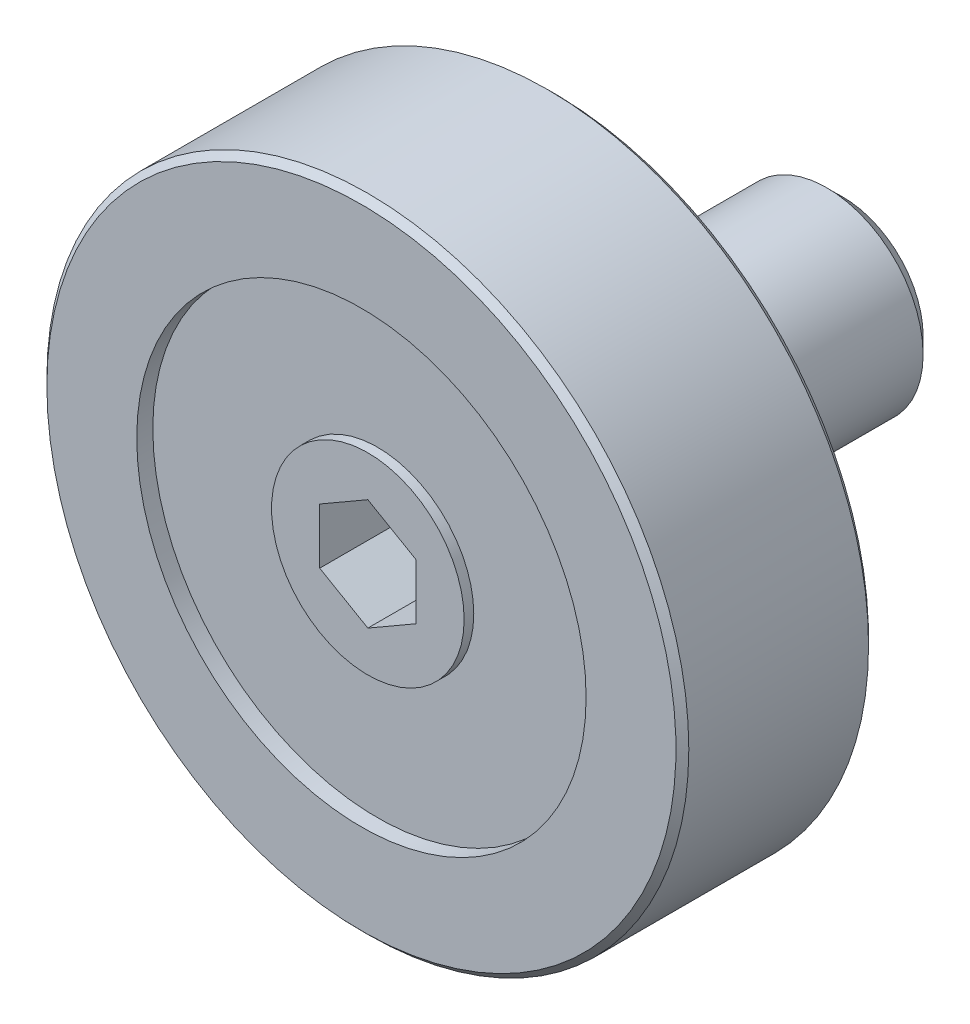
ISO-10303-21;
HEADER;
FILE_DESCRIPTION(('STEP AP214'),'2;1');
FILE_NAME('part.step','',(''),(''),'','','');
FILE_SCHEMA(('AUTOMOTIVE_DESIGN { 1 0 10303 214 1 1 1 1 }'));
ENDSEC;
DATA;
#1=APPLICATION_CONTEXT('core data for automotive mechanical design processes');
#2=APPLICATION_PROTOCOL_DEFINITION('international standard','automotive_design',2000,#1);
#3=PRODUCT_CONTEXT('',#1,'mechanical');
#4=PRODUCT('Part','Part','',(#3));
#5=PRODUCT_RELATED_PRODUCT_CATEGORY('part','',(#4));
#6=PRODUCT_DEFINITION_FORMATION('','',#4);
#7=PRODUCT_DEFINITION_CONTEXT('part definition',#1,'design');
#8=PRODUCT_DEFINITION('design','',#6,#7);
#9=PRODUCT_DEFINITION_SHAPE('','',#8);
#10=(LENGTH_UNIT() NAMED_UNIT(*) SI_UNIT(.MILLI.,.METRE.));
#11=(NAMED_UNIT(*) PLANE_ANGLE_UNIT() SI_UNIT($,.RADIAN.));
#12=(NAMED_UNIT(*) SI_UNIT($,.STERADIAN.) SOLID_ANGLE_UNIT());
#13=UNCERTAINTY_MEASURE_WITH_UNIT(LENGTH_MEASURE(1.E-05),#10,'distance_accuracy_value','');
#14=(GEOMETRIC_REPRESENTATION_CONTEXT(3) GLOBAL_UNCERTAINTY_ASSIGNED_CONTEXT((#13)) GLOBAL_UNIT_ASSIGNED_CONTEXT((#10,
#11,#12)) REPRESENTATION_CONTEXT('',''));
#15=CARTESIAN_POINT('',(0.,0.,0.));
#16=DIRECTION('',(0.,0.,1.));
#17=DIRECTION('',(1.,0.,0.));
#18=AXIS2_PLACEMENT_3D('',#15,#16,#17);
#19=CARTESIAN_POINT('',(0.,8.5,1.));
#20=DIRECTION('',(0.,0.,1.));
#21=DIRECTION('',(1.,0.,0.));
#22=AXIS2_PLACEMENT_3D('',#19,#20,#21);
#23=PLANE('',#22);
#24=CARTESIAN_POINT('',(0.,0.,1.));
#25=DIRECTION('',(0.,0.,-1.));
#26=DIRECTION('',(-1.,0.,0.));
#27=AXIS2_PLACEMENT_3D('',#24,#25,#26);
#28=CIRCLE('',#27,9.8);
#29=CARTESIAN_POINT('',(-9.8,0.,1.));
#30=VERTEX_POINT('',#29);
#31=EDGE_CURVE('E432',#30,#30,#28,.T.);
#32=ORIENTED_EDGE('',*,*,#31,.T.);
#33=EDGE_LOOP('',(#32));
#34=FACE_BOUND('',#33,.T.);
#35=CARTESIAN_POINT('',(0.,0.,1.));
#36=DIRECTION('',(0.,0.,1.));
#37=DIRECTION('',(1.,0.,0.));
#38=AXIS2_PLACEMENT_3D('',#35,#36,#37);
#39=CIRCLE('',#38,7.);
#40=CARTESIAN_POINT('',(7.,0.,1.));
#41=VERTEX_POINT('',#40);
#42=EDGE_CURVE('E134',#41,#41,#39,.T.);
#43=ORIENTED_EDGE('',*,*,#42,.T.);
#44=EDGE_LOOP('',(#43));
#45=FACE_BOUND('',#44,.T.);
#46=ADVANCED_FACE('F14',(#34,#45),#23,.F.);
#47=CARTESIAN_POINT('',(0.,0.,-8.));
#48=DIRECTION('',(0.,0.,1.));
#49=DIRECTION('',(1.,0.,0.));
#50=AXIS2_PLACEMENT_3D('',#47,#48,#49);
#51=PLANE('',#50);
#52=CARTESIAN_POINT('',(0.,0.,-8.));
#53=DIRECTION('',(0.,0.,1.));
#54=DIRECTION('',(1.,0.,0.));
#55=AXIS2_PLACEMENT_3D('',#52,#53,#54);
#56=CIRCLE('',#55,2.49999999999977);
#57=CARTESIAN_POINT('',(2.49999999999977,0.,-8.));
#58=VERTEX_POINT('',#57);
#59=EDGE_CURVE('E9',#58,#58,#56,.T.);
#60=ORIENTED_EDGE('',*,*,#59,.F.);
#61=EDGE_LOOP('',(#60));
#62=FACE_BOUND('',#61,.T.);
#63=ADVANCED_FACE('F16',(#62),#51,.F.);
#64=CARTESIAN_POINT('',(0.,0.,-8.));
#65=DIRECTION('',(0.,0.,1.));
#66=DIRECTION('',(1.,0.,0.));
#67=AXIS2_PLACEMENT_3D('',#64,#65,#66);
#68=CONICAL_SURFACE('',#67,2.49999999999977,0.785398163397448);
#69=CARTESIAN_POINT('',(0.,0.,-7.5));
#70=DIRECTION('',(0.,0.,1.));
#71=DIRECTION('',(1.,0.,0.));
#72=AXIS2_PLACEMENT_3D('',#69,#70,#71);
#73=CIRCLE('',#72,2.99999999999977);
#74=CARTESIAN_POINT('',(2.99999999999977,0.,-7.5));
#75=VERTEX_POINT('',#74);
#76=EDGE_CURVE('E22',#75,#75,#73,.T.);
#77=ORIENTED_EDGE('',*,*,#76,.F.);
#78=EDGE_LOOP('',(#77));
#79=FACE_BOUND('',#78,.T.);
#80=ORIENTED_EDGE('',*,*,#59,.T.);
#81=EDGE_LOOP('',(#80));
#82=FACE_BOUND('',#81,.T.);
#83=ADVANCED_FACE('F159',(#79,#82),#68,.T.);
#84=CARTESIAN_POINT('',(0.,0.,10.));
#85=DIRECTION('',(0.,0.,1.));
#86=DIRECTION('',(1.,0.,0.));
#87=AXIS2_PLACEMENT_3D('',#84,#85,#86);
#88=CYLINDRICAL_SURFACE('',#87,2.99999999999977);
#89=CARTESIAN_POINT('',(0.,0.,-2.));
#90=DIRECTION('',(0.,0.,1.));
#91=DIRECTION('',(1.,0.,0.));
#92=AXIS2_PLACEMENT_3D('',#89,#90,#91);
#93=CIRCLE('',#92,2.99999999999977);
#94=CARTESIAN_POINT('',(2.99999999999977,0.,-2.));
#95=VERTEX_POINT('',#94);
#96=EDGE_CURVE('E152',#95,#95,#93,.T.);
#97=ORIENTED_EDGE('',*,*,#96,.F.);
#98=EDGE_LOOP('',(#97));
#99=FACE_BOUND('',#98,.T.);
#100=ORIENTED_EDGE('',*,*,#76,.T.);
#101=EDGE_LOOP('',(#100));
#102=FACE_BOUND('',#101,.T.);
#103=ADVANCED_FACE('F157',(#99,#102),#88,.T.);
#104=CARTESIAN_POINT('',(0.,2.34999999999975,-2.));
#105=DIRECTION('',(0.,0.,-1.));
#106=DIRECTION('',(-1.,0.,0.));
#107=AXIS2_PLACEMENT_3D('',#104,#105,#106);
#108=PLANE('',#107);
#109=CARTESIAN_POINT('',(0.,0.,-2.));
#110=DIRECTION('',(0.,0.,1.));
#111=DIRECTION('',(1.,0.,0.));
#112=AXIS2_PLACEMENT_3D('',#109,#110,#111);
#113=CIRCLE('',#112,2.34999999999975);
#114=CARTESIAN_POINT('',(2.34999999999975,0.,-2.));
#115=VERTEX_POINT('',#114);
#116=EDGE_CURVE('E149',#115,#115,#113,.T.);
#117=ORIENTED_EDGE('',*,*,#116,.F.);
#118=EDGE_LOOP('',(#117));
#119=FACE_BOUND('',#118,.T.);
#120=ORIENTED_EDGE('',*,*,#96,.T.);
#121=EDGE_LOOP('',(#120));
#122=FACE_BOUND('',#121,.T.);
#123=ADVANCED_FACE('F199',(#119,#122),#108,.F.);
#124=CARTESIAN_POINT('',(0.,0.,10.));
#125=DIRECTION('',(0.,0.,1.));
#126=DIRECTION('',(1.,0.,0.));
#127=AXIS2_PLACEMENT_3D('',#124,#125,#126);
#128=CYLINDRICAL_SURFACE('',#127,2.34999999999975);
#129=CARTESIAN_POINT('',(0.,0.,0.));
#130=DIRECTION('',(0.,0.,1.));
#131=DIRECTION('',(1.,0.,0.));
#132=AXIS2_PLACEMENT_3D('',#129,#130,#131);
#133=CIRCLE('',#132,2.34999999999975);
#134=CARTESIAN_POINT('',(2.34999999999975,0.,0.));
#135=VERTEX_POINT('',#134);
#136=EDGE_CURVE('E146',#135,#135,#133,.T.);
#137=ORIENTED_EDGE('',*,*,#136,.F.);
#138=EDGE_LOOP('',(#137));
#139=FACE_BOUND('',#138,.T.);
#140=ORIENTED_EDGE('',*,*,#116,.T.);
#141=EDGE_LOOP('',(#140));
#142=FACE_BOUND('',#141,.T.);
#143=ADVANCED_FACE('F195',(#139,#142),#128,.T.);
#144=CARTESIAN_POINT('',(0.,3.99999999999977,0.));
#145=DIRECTION('',(0.,0.,1.));
#146=DIRECTION('',(1.,0.,0.));
#147=AXIS2_PLACEMENT_3D('',#144,#145,#146);
#148=PLANE('',#147);
#149=CARTESIAN_POINT('',(0.,0.,0.));
#150=DIRECTION('',(0.,0.,1.));
#151=DIRECTION('',(1.,0.,0.));
#152=AXIS2_PLACEMENT_3D('',#149,#150,#151);
#153=CIRCLE('',#152,3.99999999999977);
#154=CARTESIAN_POINT('',(3.99999999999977,0.,0.));
#155=VERTEX_POINT('',#154);
#156=EDGE_CURVE('E143',#155,#155,#153,.T.);
#157=ORIENTED_EDGE('',*,*,#156,.F.);
#158=EDGE_LOOP('',(#157));
#159=FACE_BOUND('',#158,.T.);
#160=ORIENTED_EDGE('',*,*,#136,.T.);
#161=EDGE_LOOP('',(#160));
#162=FACE_BOUND('',#161,.T.);
#163=ADVANCED_FACE('F191',(#159,#162),#148,.F.);
#164=CARTESIAN_POINT('',(0.,0.,10.));
#165=DIRECTION('',(0.,0.,1.));
#166=DIRECTION('',(1.,0.,0.));
#167=AXIS2_PLACEMENT_3D('',#164,#165,#166);
#168=CYLINDRICAL_SURFACE('',#167,3.99999999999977);
#169=CARTESIAN_POINT('',(0.,0.,1.5));
#170=DIRECTION('',(0.,0.,1.));
#171=DIRECTION('',(1.,0.,0.));
#172=AXIS2_PLACEMENT_3D('',#169,#170,#171);
#173=CIRCLE('',#172,3.99999999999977);
#174=CARTESIAN_POINT('',(3.99999999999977,0.,1.5));
#175=VERTEX_POINT('',#174);
#176=EDGE_CURVE('E140',#175,#175,#173,.T.);
#177=ORIENTED_EDGE('',*,*,#176,.F.);
#178=EDGE_LOOP('',(#177));
#179=FACE_BOUND('',#178,.T.);
#180=ORIENTED_EDGE('',*,*,#156,.T.);
#181=EDGE_LOOP('',(#180));
#182=FACE_BOUND('',#181,.T.);
#183=ADVANCED_FACE('F187',(#179,#182),#168,.T.);
#184=CARTESIAN_POINT('',(0.,3.99999999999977,1.5));
#185=DIRECTION('',(0.,0.,1.));
#186=DIRECTION('',(1.,0.,0.));
#187=AXIS2_PLACEMENT_3D('',#184,#185,#186);
#188=PLANE('',#187);
#189=CARTESIAN_POINT('',(0.,0.,1.5));
#190=DIRECTION('',(0.,0.,1.));
#191=DIRECTION('',(1.,0.,0.));
#192=AXIS2_PLACEMENT_3D('',#189,#190,#191);
#193=CIRCLE('',#192,7.);
#194=CARTESIAN_POINT('',(7.,0.,1.5));
#195=VERTEX_POINT('',#194);
#196=EDGE_CURVE('E137',#195,#195,#193,.T.);
#197=ORIENTED_EDGE('',*,*,#196,.F.);
#198=EDGE_LOOP('',(#197));
#199=FACE_BOUND('',#198,.T.);
#200=ORIENTED_EDGE('',*,*,#176,.T.);
#201=EDGE_LOOP('',(#200));
#202=FACE_BOUND('',#201,.T.);
#203=ADVANCED_FACE('F183',(#199,#202),#188,.F.);
#204=CARTESIAN_POINT('',(0.,0.,10.));
#205=DIRECTION('',(0.,0.,1.));
#206=DIRECTION('',(1.,0.,0.));
#207=AXIS2_PLACEMENT_3D('',#204,#205,#206);
#208=CYLINDRICAL_SURFACE('',#207,7.);
#209=ORIENTED_EDGE('',*,*,#42,.F.);
#210=EDGE_LOOP('',(#209));
#211=FACE_BOUND('',#210,.T.);
#212=ORIENTED_EDGE('',*,*,#196,.T.);
#213=EDGE_LOOP('',(#212));
#214=FACE_BOUND('',#213,.T.);
#215=ADVANCED_FACE('F179',(#211,#214),#208,.F.);
#216=CARTESIAN_POINT('',(0.,0.,6.8));
#217=DIRECTION('',(0.,0.,-1.));
#218=DIRECTION('',(-1.,0.,0.));
#219=AXIS2_PLACEMENT_3D('',#216,#217,#218);
#220=CONICAL_SURFACE('',#219,10.,0.785398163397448);
#221=CARTESIAN_POINT('',(0.,0.,7.));
#222=DIRECTION('',(0.,0.,-1.));
#223=DIRECTION('',(-1.,0.,0.));
#224=AXIS2_PLACEMENT_3D('',#221,#222,#223);
#225=CIRCLE('',#224,9.8);
#226=CARTESIAN_POINT('',(-9.8,0.,7.));
#227=VERTEX_POINT('',#226);
#228=EDGE_CURVE('E104',#227,#227,#225,.T.);
#229=ORIENTED_EDGE('',*,*,#228,.T.);
#230=EDGE_LOOP('',(#229));
#231=FACE_BOUND('',#230,.T.);
#232=CARTESIAN_POINT('',(0.,0.,6.8));
#233=DIRECTION('',(0.,0.,-1.));
#234=DIRECTION('',(-1.,0.,0.));
#235=AXIS2_PLACEMENT_3D('',#232,#233,#234);
#236=CIRCLE('',#235,10.);
#237=CARTESIAN_POINT('',(-10.,0.,6.8));
#238=VERTEX_POINT('',#237);
#239=EDGE_CURVE('E413',#238,#238,#236,.T.);
#240=ORIENTED_EDGE('',*,*,#239,.F.);
#241=EDGE_LOOP('',(#240));
#242=FACE_BOUND('',#241,.T.);
#243=ADVANCED_FACE('F182',(#231,#242),#220,.T.);
#244=CARTESIAN_POINT('',(0.,0.,-7.5));
#245=DIRECTION('',(0.,0.,-1.));
#246=DIRECTION('',(-1.,0.,0.));
#247=AXIS2_PLACEMENT_3D('',#244,#245,#246);
#248=CYLINDRICAL_SURFACE('',#247,10.);
#249=ORIENTED_EDGE('',*,*,#239,.T.);
#250=EDGE_LOOP('',(#249));
#251=FACE_BOUND('',#250,.T.);
#252=CARTESIAN_POINT('',(0.,0.,1.2));
#253=DIRECTION('',(0.,0.,-1.));
#254=DIRECTION('',(-1.,0.,0.));
#255=AXIS2_PLACEMENT_3D('',#252,#253,#254);
#256=CIRCLE('',#255,10.);
#257=CARTESIAN_POINT('',(-10.,0.,1.2));
#258=VERTEX_POINT('',#257);
#259=EDGE_CURVE('E416',#258,#258,#256,.T.);
#260=ORIENTED_EDGE('',*,*,#259,.F.);
#261=EDGE_LOOP('',(#260));
#262=FACE_BOUND('',#261,.T.);
#263=ADVANCED_FACE('F251',(#251,#262),#248,.T.);
#264=CARTESIAN_POINT('',(0.,0.,1.));
#265=DIRECTION('',(0.,0.,1.));
#266=DIRECTION('',(1.,0.,0.));
#267=AXIS2_PLACEMENT_3D('',#264,#265,#266);
#268=CONICAL_SURFACE('',#267,9.8,0.785398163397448);
#269=ORIENTED_EDGE('',*,*,#259,.T.);
#270=EDGE_LOOP('',(#269));
#271=FACE_BOUND('',#270,.T.);
#272=ORIENTED_EDGE('',*,*,#31,.F.);
#273=EDGE_LOOP('',(#272));
#274=FACE_BOUND('',#273,.T.);
#275=ADVANCED_FACE('F260',(#271,#274),#268,.T.);
#276=CARTESIAN_POINT('',(0.,0.,4.3));
#277=DIRECTION('',(0.,0.,1.));
#278=DIRECTION('',(1.,0.,0.));
#279=AXIS2_PLACEMENT_3D('',#276,#277,#278);
#280=PLANE('',#279);
#281=DIRECTION('',(-0.866025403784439,0.5,0.));
#282=VECTOR('',#281,1.);
#283=CARTESIAN_POINT('',(1.5,0.86602540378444,4.3));
#284=LINE('',#283,#282);
#285=CARTESIAN_POINT('',(1.5,0.86602540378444,4.3));
#286=VERTEX_POINT('',#285);
#287=CARTESIAN_POINT('',(0.,1.73205080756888,4.3));
#288=VERTEX_POINT('',#287);
#289=EDGE_CURVE('E115',#286,#288,#284,.T.);
#290=ORIENTED_EDGE('',*,*,#289,.T.);
#291=DIRECTION('',(-0.866025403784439,-0.5,0.));
#292=VECTOR('',#291,1.);
#293=CARTESIAN_POINT('',(0.,1.73205080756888,4.3));
#294=LINE('',#293,#292);
#295=CARTESIAN_POINT('',(-1.5,0.866025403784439,4.3));
#296=VERTEX_POINT('',#295);
#297=EDGE_CURVE('E97',#288,#296,#294,.T.);
#298=ORIENTED_EDGE('',*,*,#297,.T.);
#299=DIRECTION('',(0.,-1.,0.));
#300=VECTOR('',#299,1.);
#301=CARTESIAN_POINT('',(-1.5,0.866025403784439,4.3));
#302=LINE('',#301,#300);
#303=CARTESIAN_POINT('',(-1.5,-0.866025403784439,4.3));
#304=VERTEX_POINT('',#303);
#305=EDGE_CURVE('E95',#296,#304,#302,.T.);
#306=ORIENTED_EDGE('',*,*,#305,.T.);
#307=DIRECTION('',(0.866025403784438,-0.5,0.));
#308=VECTOR('',#307,1.);
#309=CARTESIAN_POINT('',(-1.5,-0.866025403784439,4.3));
#310=LINE('',#309,#308);
#311=CARTESIAN_POINT('',(0.,-1.73205080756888,4.3));
#312=VERTEX_POINT('',#311);
#313=EDGE_CURVE('E74',#304,#312,#310,.T.);
#314=ORIENTED_EDGE('',*,*,#313,.T.);
#315=DIRECTION('',(0.866025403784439,0.5,0.));
#316=VECTOR('',#315,1.);
#317=CARTESIAN_POINT('',(0.,-1.73205080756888,4.3));
#318=LINE('',#317,#316);
#319=CARTESIAN_POINT('',(1.5,-0.866025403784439,4.3));
#320=VERTEX_POINT('',#319);
#321=EDGE_CURVE('E85',#312,#320,#318,.T.);
#322=ORIENTED_EDGE('',*,*,#321,.T.);
#323=DIRECTION('',(0.,1.,0.));
#324=VECTOR('',#323,1.);
#325=CARTESIAN_POINT('',(1.5,-0.866025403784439,4.3));
#326=LINE('',#325,#324);
#327=EDGE_CURVE('E89',#320,#286,#326,.T.);
#328=ORIENTED_EDGE('',*,*,#327,.T.);
#329=EDGE_LOOP('',(#290,#298,#306,#314,#322,#328));
#330=FACE_BOUND('',#329,.T.);
#331=ADVANCED_FACE('F92',(#330),#280,.T.);
#332=CARTESIAN_POINT('',(-1.5,0.866025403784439,4.3));
#333=DIRECTION('',(-1.,0.,0.));
#334=DIRECTION('',(0.,-1.,0.));
#335=AXIS2_PLACEMENT_3D('',#332,#333,#334);
#336=PLANE('',#335);
#337=DIRECTION('',(0.,-1.,0.));
#338=VECTOR('',#337,1.);
#339=CARTESIAN_POINT('',(-1.5,0.866025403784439,6.8));
#340=LINE('',#339,#338);
#341=CARTESIAN_POINT('',(-1.5,0.866025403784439,6.8));
#342=VERTEX_POINT('',#341);
#343=CARTESIAN_POINT('',(-1.5,-0.866025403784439,6.8));
#344=VERTEX_POINT('',#343);
#345=EDGE_CURVE('E107',#342,#344,#340,.T.);
#346=ORIENTED_EDGE('',*,*,#345,.T.);
#347=DIRECTION('',(0.,0.,1.));
#348=VECTOR('',#347,1.);
#349=CARTESIAN_POINT('',(-1.5,-0.866025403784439,4.3));
#350=LINE('',#349,#348);
#351=EDGE_CURVE('E82',#304,#344,#350,.T.);
#352=ORIENTED_EDGE('',*,*,#351,.F.);
#353=ORIENTED_EDGE('',*,*,#305,.F.);
#354=DIRECTION('',(0.,0.,1.));
#355=VECTOR('',#354,1.);
#356=CARTESIAN_POINT('',(-1.5,0.866025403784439,4.3));
#357=LINE('',#356,#355);
#358=EDGE_CURVE('E120',#296,#342,#357,.T.);
#359=ORIENTED_EDGE('',*,*,#358,.T.);
#360=EDGE_LOOP('',(#346,#352,#353,#359));
#361=FACE_BOUND('',#360,.T.);
#362=ADVANCED_FACE('F277',(#361),#336,.F.);
#363=CARTESIAN_POINT('',(-1.5,-0.866025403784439,4.3));
#364=DIRECTION('',(-0.5,-0.866025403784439,0.));
#365=DIRECTION('',(0.866025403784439,-0.5,0.));
#366=AXIS2_PLACEMENT_3D('',#363,#364,#365);
#367=PLANE('',#366);
#368=DIRECTION('',(0.866025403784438,-0.5,0.));
#369=VECTOR('',#368,1.);
#370=CARTESIAN_POINT('',(-1.5,-0.866025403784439,6.8));
#371=LINE('',#370,#369);
#372=CARTESIAN_POINT('',(0.,-1.73205080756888,6.8));
#373=VERTEX_POINT('',#372);
#374=EDGE_CURVE('E77',#344,#373,#371,.T.);
#375=ORIENTED_EDGE('',*,*,#374,.T.);
#376=DIRECTION('',(0.,0.,1.));
#377=VECTOR('',#376,1.);
#378=CARTESIAN_POINT('',(0.,-1.73205080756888,4.3));
#379=LINE('',#378,#377);
#380=EDGE_CURVE('E70',#312,#373,#379,.T.);
#381=ORIENTED_EDGE('',*,*,#380,.F.);
#382=ORIENTED_EDGE('',*,*,#313,.F.);
#383=ORIENTED_EDGE('',*,*,#351,.T.);
#384=EDGE_LOOP('',(#375,#381,#382,#383));
#385=FACE_BOUND('',#384,.T.);
#386=ADVANCED_FACE('F72',(#385),#367,.F.);
#387=CARTESIAN_POINT('',(0.,-1.73205080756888,4.3));
#388=DIRECTION('',(0.5,-0.866025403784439,0.));
#389=DIRECTION('',(0.866025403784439,0.5,0.));
#390=AXIS2_PLACEMENT_3D('',#387,#388,#389);
#391=PLANE('',#390);
#392=DIRECTION('',(0.866025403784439,0.5,0.));
#393=VECTOR('',#392,1.);
#394=CARTESIAN_POINT('',(0.,-1.73205080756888,6.8));
#395=LINE('',#394,#393);
#396=CARTESIAN_POINT('',(1.5,-0.866025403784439,6.8));
#397=VERTEX_POINT('',#396);
#398=EDGE_CURVE('E111',#373,#397,#395,.T.);
#399=ORIENTED_EDGE('',*,*,#398,.T.);
#400=DIRECTION('',(0.,0.,1.));
#401=VECTOR('',#400,1.);
#402=CARTESIAN_POINT('',(1.5,-0.866025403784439,4.3));
#403=LINE('',#402,#401);
#404=EDGE_CURVE('E81',#320,#397,#403,.T.);
#405=ORIENTED_EDGE('',*,*,#404,.F.);
#406=ORIENTED_EDGE('',*,*,#321,.F.);
#407=ORIENTED_EDGE('',*,*,#380,.T.);
#408=EDGE_LOOP('',(#399,#405,#406,#407));
#409=FACE_BOUND('',#408,.T.);
#410=ADVANCED_FACE('F86',(#409),#391,.F.);
#411=CARTESIAN_POINT('',(1.5,-0.866025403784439,4.3));
#412=DIRECTION('',(1.,0.,0.));
#413=DIRECTION('',(0.,0.,-1.));
#414=AXIS2_PLACEMENT_3D('',#411,#412,#413);
#415=PLANE('',#414);
#416=DIRECTION('',(0.,1.,0.));
#417=VECTOR('',#416,1.);
#418=CARTESIAN_POINT('',(1.5,-0.866025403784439,6.8));
#419=LINE('',#418,#417);
#420=CARTESIAN_POINT('',(1.5,0.86602540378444,6.8));
#421=VERTEX_POINT('',#420);
#422=EDGE_CURVE('E113',#397,#421,#419,.T.);
#423=ORIENTED_EDGE('',*,*,#422,.T.);
#424=DIRECTION('',(0.,0.,1.));
#425=VECTOR('',#424,1.);
#426=CARTESIAN_POINT('',(1.5,0.86602540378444,4.3));
#427=LINE('',#426,#425);
#428=EDGE_CURVE('E37',#286,#421,#427,.T.);
#429=ORIENTED_EDGE('',*,*,#428,.F.);
#430=ORIENTED_EDGE('',*,*,#327,.F.);
#431=ORIENTED_EDGE('',*,*,#404,.T.);
#432=EDGE_LOOP('',(#423,#429,#430,#431));
#433=FACE_BOUND('',#432,.T.);
#434=ADVANCED_FACE('F300',(#433),#415,.F.);
#435=CARTESIAN_POINT('',(1.5,0.86602540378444,4.3));
#436=DIRECTION('',(0.5,0.866025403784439,0.));
#437=DIRECTION('',(-0.866025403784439,0.5,0.));
#438=AXIS2_PLACEMENT_3D('',#435,#436,#437);
#439=PLANE('',#438);
#440=DIRECTION('',(-0.866025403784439,0.5,0.));
#441=VECTOR('',#440,1.);
#442=CARTESIAN_POINT('',(1.5,0.86602540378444,6.8));
#443=LINE('',#442,#441);
#444=CARTESIAN_POINT('',(0.,1.73205080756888,6.8));
#445=VERTEX_POINT('',#444);
#446=EDGE_CURVE('E29',#421,#445,#443,.T.);
#447=ORIENTED_EDGE('',*,*,#446,.T.);
#448=DIRECTION('',(0.,0.,1.));
#449=VECTOR('',#448,1.);
#450=CARTESIAN_POINT('',(0.,1.73205080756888,4.3));
#451=LINE('',#450,#449);
#452=EDGE_CURVE('E59',#288,#445,#451,.T.);
#453=ORIENTED_EDGE('',*,*,#452,.F.);
#454=ORIENTED_EDGE('',*,*,#289,.F.);
#455=ORIENTED_EDGE('',*,*,#428,.T.);
#456=EDGE_LOOP('',(#447,#453,#454,#455));
#457=FACE_BOUND('',#456,.T.);
#458=ADVANCED_FACE('F308',(#457),#439,.F.);
#459=CARTESIAN_POINT('',(0.,1.73205080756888,4.3));
#460=DIRECTION('',(-0.5,0.866025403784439,0.));
#461=DIRECTION('',(-0.866025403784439,-0.5,0.));
#462=AXIS2_PLACEMENT_3D('',#459,#460,#461);
#463=PLANE('',#462);
#464=DIRECTION('',(-0.866025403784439,-0.5,0.));
#465=VECTOR('',#464,1.);
#466=CARTESIAN_POINT('',(0.,1.73205080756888,6.8));
#467=LINE('',#466,#465);
#468=EDGE_CURVE('E103',#445,#342,#467,.T.);
#469=ORIENTED_EDGE('',*,*,#468,.T.);
#470=ORIENTED_EDGE('',*,*,#358,.F.);
#471=ORIENTED_EDGE('',*,*,#297,.F.);
#472=ORIENTED_EDGE('',*,*,#452,.T.);
#473=EDGE_LOOP('',(#469,#470,#471,#472));
#474=FACE_BOUND('',#473,.T.);
#475=ADVANCED_FACE('F316',(#474),#463,.F.);
#476=CARTESIAN_POINT('',(0.,3.,6.8));
#477=DIRECTION('',(0.,0.,-1.));
#478=DIRECTION('',(-1.,0.,0.));
#479=AXIS2_PLACEMENT_3D('',#476,#477,#478);
#480=PLANE('',#479);
#481=ORIENTED_EDGE('',*,*,#468,.F.);
#482=ORIENTED_EDGE('',*,*,#446,.F.);
#483=ORIENTED_EDGE('',*,*,#422,.F.);
#484=ORIENTED_EDGE('',*,*,#398,.F.);
#485=ORIENTED_EDGE('',*,*,#374,.F.);
#486=ORIENTED_EDGE('',*,*,#345,.F.);
#487=EDGE_LOOP('',(#481,#482,#483,#484,#485,#486));
#488=FACE_BOUND('',#487,.T.);
#489=CARTESIAN_POINT('',(0.,0.,6.8));
#490=DIRECTION('',(0.,0.,1.));
#491=DIRECTION('',(1.,0.,0.));
#492=AXIS2_PLACEMENT_3D('',#489,#490,#491);
#493=CIRCLE('',#492,3.);
#494=CARTESIAN_POINT('',(3.,0.,6.8));
#495=VERTEX_POINT('',#494);
#496=EDGE_CURVE('E117',#495,#495,#493,.T.);
#497=ORIENTED_EDGE('',*,*,#496,.T.);
#498=EDGE_LOOP('',(#497));
#499=FACE_BOUND('',#498,.T.);
#500=ADVANCED_FACE('F324',(#488,#499),#480,.F.);
#501=CARTESIAN_POINT('',(0.,0.,10.));
#502=DIRECTION('',(0.,0.,1.));
#503=DIRECTION('',(1.,0.,0.));
#504=AXIS2_PLACEMENT_3D('',#501,#502,#503);
#505=CYLINDRICAL_SURFACE('',#504,3.);
#506=ORIENTED_EDGE('',*,*,#496,.F.);
#507=EDGE_LOOP('',(#506));
#508=FACE_BOUND('',#507,.T.);
#509=CARTESIAN_POINT('',(0.,0.,6.5));
#510=DIRECTION('',(0.,0.,1.));
#511=DIRECTION('',(1.,0.,0.));
#512=AXIS2_PLACEMENT_3D('',#509,#510,#511);
#513=CIRCLE('',#512,3.);
#514=CARTESIAN_POINT('',(3.,0.,6.5));
#515=VERTEX_POINT('',#514);
#516=EDGE_CURVE('E125',#515,#515,#513,.T.);
#517=ORIENTED_EDGE('',*,*,#516,.T.);
#518=EDGE_LOOP('',(#517));
#519=FACE_BOUND('',#518,.T.);
#520=ADVANCED_FACE('F333',(#508,#519),#505,.T.);
#521=CARTESIAN_POINT('',(0.,3.,6.5));
#522=DIRECTION('',(0.,0.,-1.));
#523=DIRECTION('',(-1.,0.,0.));
#524=AXIS2_PLACEMENT_3D('',#521,#522,#523);
#525=PLANE('',#524);
#526=ORIENTED_EDGE('',*,*,#516,.F.);
#527=EDGE_LOOP('',(#526));
#528=FACE_BOUND('',#527,.T.);
#529=CARTESIAN_POINT('',(0.,0.,6.5));
#530=DIRECTION('',(0.,0.,1.));
#531=DIRECTION('',(1.,0.,0.));
#532=AXIS2_PLACEMENT_3D('',#529,#530,#531);
#533=CIRCLE('',#532,7.);
#534=CARTESIAN_POINT('',(7.,0.,6.5));
#535=VERTEX_POINT('',#534);
#536=EDGE_CURVE('E128',#535,#535,#533,.T.);
#537=ORIENTED_EDGE('',*,*,#536,.T.);
#538=EDGE_LOOP('',(#537));
#539=FACE_BOUND('',#538,.T.);
#540=ADVANCED_FACE('F342',(#528,#539),#525,.F.);
#541=CARTESIAN_POINT('',(0.,0.,10.));
#542=DIRECTION('',(0.,0.,1.));
#543=DIRECTION('',(1.,0.,0.));
#544=AXIS2_PLACEMENT_3D('',#541,#542,#543);
#545=CYLINDRICAL_SURFACE('',#544,7.);
#546=ORIENTED_EDGE('',*,*,#536,.F.);
#547=EDGE_LOOP('',(#546));
#548=FACE_BOUND('',#547,.T.);
#549=CARTESIAN_POINT('',(0.,0.,7.));
#550=DIRECTION('',(0.,0.,1.));
#551=DIRECTION('',(1.,0.,0.));
#552=AXIS2_PLACEMENT_3D('',#549,#550,#551);
#553=CIRCLE('',#552,7.);
#554=CARTESIAN_POINT('',(7.,0.,7.));
#555=VERTEX_POINT('',#554);
#556=EDGE_CURVE('E131',#555,#555,#553,.T.);
#557=ORIENTED_EDGE('',*,*,#556,.T.);
#558=EDGE_LOOP('',(#557));
#559=FACE_BOUND('',#558,.T.);
#560=ADVANCED_FACE('F351',(#548,#559),#545,.F.);
#561=CARTESIAN_POINT('',(0.,8.5,7.));
#562=DIRECTION('',(0.,0.,-1.));
#563=DIRECTION('',(-1.,0.,0.));
#564=AXIS2_PLACEMENT_3D('',#561,#562,#563);
#565=PLANE('',#564);
#566=ORIENTED_EDGE('',*,*,#556,.F.);
#567=EDGE_LOOP('',(#566));
#568=FACE_BOUND('',#567,.T.);
#569=ORIENTED_EDGE('',*,*,#228,.F.);
#570=EDGE_LOOP('',(#569));
#571=FACE_BOUND('',#570,.T.);
#572=ADVANCED_FACE('F177',(#568,#571),#565,.F.);
#573=CLOSED_SHELL('',(#46,#63,#83,#103,#123,#143,#163,#183,#203,#215,#243,#263,#275,#331,#362,
#386,#410,#434,#458,#475,#500,#520,#540,#560,#572));
#574=MANIFOLD_SOLID_BREP('B1',#573);
#575=ADVANCED_BREP_SHAPE_REPRESENTATION('',(#18,#574),#14);
#576=SHAPE_DEFINITION_REPRESENTATION(#9,#575);
ENDSEC;
END-ISO-10303-21;
